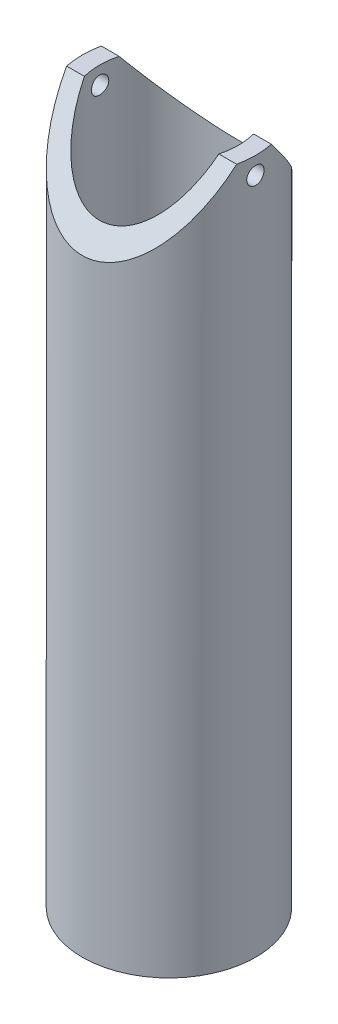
from build123d import *

# Parameters (mm, degrees)
SKETCH1_R               = 25
SKETCH1_R_2             = 20
BOSS_EXTRUDE1_DEPTH     = 200
CUT_EXTRUDE1_DEPTH      = 200
CUT_EXTRUDE1_DEPTH_BACK = 200
SKETCH2_R               = 2.5


with BuildPart() as part:
    # Sketch1 → Boss-Extrude1 (new body)
    with BuildSketch(Plane(origin=(0, 0, 0), x_dir=(1, 0, 0), z_dir=(0, 1, 0))):
        with Locations(Location((0, 0, 0), (0, 0, 270))):
            Circle(SKETCH1_R)
        with Locations(Location((0, 0, 0), (0, 0, 270))):
            Circle(SKETCH1_R_2, mode=Mode.SUBTRACT)
    extrude(amount=BOSS_EXTRUDE1_DEPTH)

    # Sketch2 → Cut-Extrude1 (cut, two sides: drawn at the far end of the back side and taken through both)
    with BuildSketch(Plane(origin=(0, 0, 0), x_dir=(0, 0, -1), z_dir=(1, 0, 0)).offset(-CUT_EXTRUDE1_DEPTH_BACK)):
        with Locations(Location((0, 195, 0), (0, 0, 180))):
            Circle(SKETCH2_R)
        Polygon((25, 175), (5, 200), (-5, 200), (-25, 175), (-25, 205.937261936), (25, 205.937261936), align=None)
    extrude(amount=CUT_EXTRUDE1_DEPTH + CUT_EXTRUDE1_DEPTH_BACK, mode=Mode.SUBTRACT)


solid = part.part
